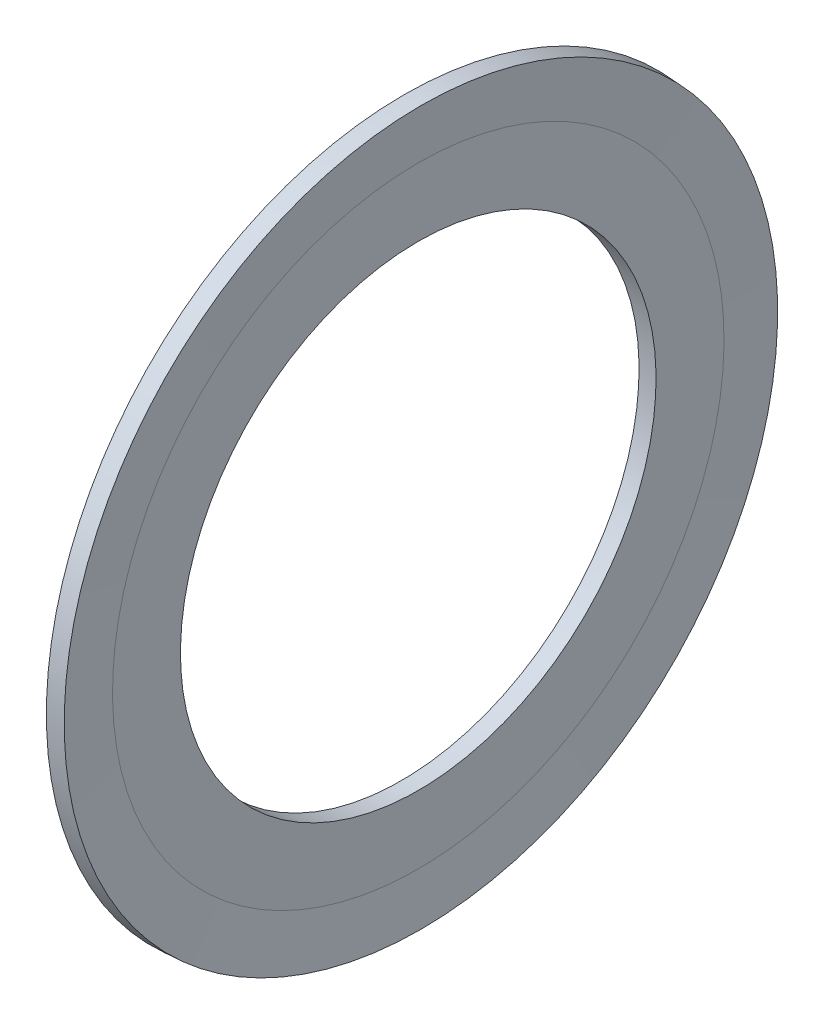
ISO-10303-21;
HEADER;
FILE_DESCRIPTION(('STEP AP214'),'2;1');
FILE_NAME('part.step','',(''),(''),'','','');
FILE_SCHEMA(('AUTOMOTIVE_DESIGN { 1 0 10303 214 1 1 1 1 }'));
ENDSEC;
DATA;
#1=APPLICATION_CONTEXT('core data for automotive mechanical design processes');
#2=APPLICATION_PROTOCOL_DEFINITION('international standard','automotive_design',2000,#1);
#3=PRODUCT_CONTEXT('',#1,'mechanical');
#4=PRODUCT('Part','Part','',(#3));
#5=PRODUCT_RELATED_PRODUCT_CATEGORY('part','',(#4));
#6=PRODUCT_DEFINITION_FORMATION('','',#4);
#7=PRODUCT_DEFINITION_CONTEXT('part definition',#1,'design');
#8=PRODUCT_DEFINITION('design','',#6,#7);
#9=PRODUCT_DEFINITION_SHAPE('','',#8);
#10=(LENGTH_UNIT() NAMED_UNIT(*) SI_UNIT(.MILLI.,.METRE.));
#11=(NAMED_UNIT(*) PLANE_ANGLE_UNIT() SI_UNIT($,.RADIAN.));
#12=(NAMED_UNIT(*) SI_UNIT($,.STERADIAN.) SOLID_ANGLE_UNIT());
#13=UNCERTAINTY_MEASURE_WITH_UNIT(LENGTH_MEASURE(1.E-05),#10,'distance_accuracy_value','');
#14=(GEOMETRIC_REPRESENTATION_CONTEXT(3) GLOBAL_UNCERTAINTY_ASSIGNED_CONTEXT((#13)) GLOBAL_UNIT_ASSIGNED_CONTEXT((#10,
#11,#12)) REPRESENTATION_CONTEXT('',''));
#15=CARTESIAN_POINT('',(0.,0.,0.));
#16=DIRECTION('',(0.,0.,1.));
#17=DIRECTION('',(1.,0.,0.));
#18=AXIS2_PLACEMENT_3D('',#15,#16,#17);
#19=CARTESIAN_POINT('',(0.,0.,0.));
#20=DIRECTION('',(0.999999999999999,0.,0.));
#21=DIRECTION('',(0.,1.,0.));
#22=AXIS2_PLACEMENT_3D('',#19,#20,#21);
#23=CONICAL_SURFACE('',#22,18.,1.51843644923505);
#24=CARTESIAN_POINT('',(0.157223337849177,0.,0.));
#25=DIRECTION('',(0.999999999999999,0.,0.));
#26=DIRECTION('',(0.,1.,0.));
#27=AXIS2_PLACEMENT_3D('',#24,#25,#26);
#28=CIRCLE('',#27,21.);
#29=CARTESIAN_POINT('',(0.157223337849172,21.0000000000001,0.));
#30=VERTEX_POINT('',#29);
#31=EDGE_CURVE('E10',#30,#30,#28,.T.);
#32=CARTESIAN_POINT('',(0.,0.,0.));
#33=DIRECTION('',(0.999999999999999,0.,0.));
#34=DIRECTION('',(0.,1.,0.));
#35=AXIS2_PLACEMENT_3D('',#32,#33,#34);
#36=CIRCLE('',#35,18.);
#37=CARTESIAN_POINT('',(0.,18.0000000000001,0.));
#38=VERTEX_POINT('',#37);
#39=EDGE_CURVE('E51',#38,#38,#36,.T.);
#40=CARTESIAN_POINT('',(0.157223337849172,21.0000000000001,0.));
#41=CARTESIAN_POINT('',(0.155585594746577,20.9687500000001,0.));
#42=CARTESIAN_POINT('',(0.153947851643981,20.9375000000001,0.));
#43=CARTESIAN_POINT('',(0.15067236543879,20.8750000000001,0.));
#44=CARTESIAN_POINT('',(0.149034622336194,20.8437500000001,0.));
#45=CARTESIAN_POINT('',(0.145759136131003,20.7812500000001,0.));
#46=CARTESIAN_POINT('',(0.144121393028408,20.7500000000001,0.));
#47=CARTESIAN_POINT('',(0.140845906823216,20.6875000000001,0.));
#48=CARTESIAN_POINT('',(0.139208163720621,20.6562500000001,0.));
#49=CARTESIAN_POINT('',(0.13593267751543,20.5937500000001,0.));
#50=CARTESIAN_POINT('',(0.134294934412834,20.5625000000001,0.));
#51=CARTESIAN_POINT('',(0.131019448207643,20.5000000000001,0.));
#52=CARTESIAN_POINT('',(0.129381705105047,20.4687500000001,0.));
#53=CARTESIAN_POINT('',(0.126106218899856,20.4062500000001,0.));
#54=CARTESIAN_POINT('',(0.124468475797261,20.3750000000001,0.));
#55=CARTESIAN_POINT('',(0.121192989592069,20.3125000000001,0.));
#56=CARTESIAN_POINT('',(0.119555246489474,20.2812500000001,0.));
#57=CARTESIAN_POINT('',(0.116279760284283,20.2187500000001,0.));
#58=CARTESIAN_POINT('',(0.114642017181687,20.1875000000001,0.));
#59=CARTESIAN_POINT('',(0.111366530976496,20.1250000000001,0.));
#60=CARTESIAN_POINT('',(0.1097287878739,20.0937500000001,0.));
#61=CARTESIAN_POINT('',(0.106453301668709,20.0312500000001,0.));
#62=CARTESIAN_POINT('',(0.104815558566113,20.0000000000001,0.));
#63=CARTESIAN_POINT('',(0.101540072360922,19.9375000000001,0.));
#64=CARTESIAN_POINT('',(0.0999023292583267,19.9062500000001,0.));
#65=CARTESIAN_POINT('',(0.0966268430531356,19.8437500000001,0.));
#66=CARTESIAN_POINT('',(0.09498909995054,19.8125000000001,0.));
#67=CARTESIAN_POINT('',(0.0917136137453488,19.7500000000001,0.));
#68=CARTESIAN_POINT('',(0.0900758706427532,19.7187500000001,0.));
#69=CARTESIAN_POINT('',(0.086800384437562,19.6562500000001,0.));
#70=CARTESIAN_POINT('',(0.0851626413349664,19.6250000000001,0.));
#71=CARTESIAN_POINT('',(0.0818871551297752,19.5625000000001,0.));
#72=CARTESIAN_POINT('',(0.0802494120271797,19.5312500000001,0.));
#73=CARTESIAN_POINT('',(0.0769739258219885,19.4687500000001,0.));
#74=CARTESIAN_POINT('',(0.0753361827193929,19.4375000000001,0.));
#75=CARTESIAN_POINT('',(0.0720606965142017,19.3750000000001,0.));
#76=CARTESIAN_POINT('',(0.0704229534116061,19.3437500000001,0.));
#77=CARTESIAN_POINT('',(0.067147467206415,19.2812500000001,0.));
#78=CARTESIAN_POINT('',(0.0655097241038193,19.2500000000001,0.));
#79=CARTESIAN_POINT('',(0.0622342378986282,19.1875000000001,0.));
#80=CARTESIAN_POINT('',(0.0605964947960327,19.1562500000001,0.));
#81=CARTESIAN_POINT('',(0.0573210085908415,19.0937500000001,0.));
#82=CARTESIAN_POINT('',(0.0556832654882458,19.0625000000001,0.));
#83=CARTESIAN_POINT('',(0.0524077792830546,19.0000000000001,0.));
#84=CARTESIAN_POINT('',(0.0507700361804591,18.9687500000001,0.));
#85=CARTESIAN_POINT('',(0.0474945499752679,18.9062500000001,0.));
#86=CARTESIAN_POINT('',(0.0458568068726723,18.8750000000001,0.));
#87=CARTESIAN_POINT('',(0.0425813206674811,18.8125000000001,0.));
#88=CARTESIAN_POINT('',(0.0409435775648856,18.7812500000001,0.));
#89=CARTESIAN_POINT('',(0.0376680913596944,18.7187500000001,0.));
#90=CARTESIAN_POINT('',(0.0360303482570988,18.6875000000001,0.));
#91=CARTESIAN_POINT('',(0.0327548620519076,18.6250000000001,0.));
#92=CARTESIAN_POINT('',(0.031117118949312,18.5937500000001,0.));
#93=CARTESIAN_POINT('',(0.0278416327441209,18.5312500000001,0.));
#94=CARTESIAN_POINT('',(0.0262038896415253,18.5000000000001,0.));
#95=CARTESIAN_POINT('',(0.0229284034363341,18.4375000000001,0.));
#96=CARTESIAN_POINT('',(0.0212906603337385,18.4062500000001,0.));
#97=CARTESIAN_POINT('',(0.0180151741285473,18.3437500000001,0.));
#98=CARTESIAN_POINT('',(0.0163774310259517,18.3125000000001,0.));
#99=CARTESIAN_POINT('',(0.0131019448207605,18.2500000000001,0.));
#100=CARTESIAN_POINT('',(0.011464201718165,18.2187500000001,0.));
#101=CARTESIAN_POINT('',(0.00818871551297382,18.1562500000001,0.));
#102=CARTESIAN_POINT('',(0.00655097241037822,18.1250000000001,0.));
#103=CARTESIAN_POINT('',(0.00327548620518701,18.0625000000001,0.));
#104=CARTESIAN_POINT('',(0.00163774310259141,18.0312500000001,0.));
#105=CARTESIAN_POINT('',(0.,18.0000000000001,0.));
#106=B_SPLINE_CURVE_WITH_KNOTS('',3,(#40,#41,#42,#43,#44,#45,#46,#47,#48,#49,#50,#51,#52,#53,
#54,#55,#56,#57,#58,#59,#60,#61,#62,#63,#64,#65,#66,#67,#68,#69,#70,#71,#72,#73,#74,#75,#76,#77,
#78,#79,#80,#81,#82,#83,#84,#85,#86,#87,#88,#89,#90,#91,#92,#93,#94,#95,#96,#97,#98,#99,#100,
#101,#102,#103,#104,#105),.UNSPECIFIED.,.F.,.F.,(4,2,2,2,2,2,2,2,2,2,2,2,2,2,2,2,2,2,2,2,2,2,2,
2,2,2,2,2,2,2,2,2,4),(0.,0.0938786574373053,0.187757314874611,0.281635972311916,
0.375514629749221,0.469393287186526,0.563271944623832,0.657150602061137,0.751029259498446,
0.844907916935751,0.938786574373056,1.03266523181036,1.12654388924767,1.22042254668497,
1.31430120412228,1.40817986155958,1.50205851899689,1.59593717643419,1.6898158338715,
1.7836944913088,1.87757314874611,1.97145180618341,2.06533046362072,2.15920912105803,
2.25308777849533,2.34696643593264,2.44084509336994,2.53472375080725,2.62860240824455,
2.72248106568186,2.81635972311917,2.91023838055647,3.00411703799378),.UNSPECIFIED.);
#107=EDGE_CURVE('BSEAM29',#30,#38,#106,.T.);
#108=ORIENTED_EDGE('',*,*,#31,.T.);
#109=ORIENTED_EDGE('',*,*,#39,.F.);
#110=ORIENTED_EDGE('',*,*,#107,.T.);
#111=ORIENTED_EDGE('',*,*,#107,.F.);
#112=EDGE_LOOP('',(#108,#110,#109,#111));
#113=FACE_BOUND('',#112,.T.);
#114=ADVANCED_FACE('F29',(#113),#23,.F.);
#115=CARTESIAN_POINT('',(0.157223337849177,0.,0.));
#116=DIRECTION('',(-0.999999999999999,0.,0.));
#117=DIRECTION('',(0.,-1.,0.));
#118=AXIS2_PLACEMENT_3D('',#115,#116,#117);
#119=CONICAL_SURFACE('',#118,21.,0.0523598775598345);
#120=CARTESIAN_POINT('',(-0.841406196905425,0.,0.));
#121=DIRECTION('',(0.999999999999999,0.,0.));
#122=DIRECTION('',(0.,1.,0.));
#123=AXIS2_PLACEMENT_3D('',#120,#121,#122);
#124=CIRCLE('',#123,21.0523359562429);
#125=CARTESIAN_POINT('',(-0.84140619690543,21.052335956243,0.));
#126=VERTEX_POINT('',#125);
#127=EDGE_CURVE('E35',#126,#126,#124,.T.);
#128=ORIENTED_EDGE('',*,*,#127,.T.);
#129=EDGE_LOOP('',(#128));
#130=FACE_BOUND('',#129,.T.);
#131=ORIENTED_EDGE('',*,*,#31,.F.);
#132=EDGE_LOOP('',(#131));
#133=FACE_BOUND('',#132,.T.);
#134=ADVANCED_FACE('F59',(#130,#133),#119,.T.);
#135=CARTESIAN_POINT('',(-0.841406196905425,0.,0.));
#136=DIRECTION('',(0.999999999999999,0.,0.));
#137=DIRECTION('',(0.,1.,0.));
#138=AXIS2_PLACEMENT_3D('',#135,#136,#137);
#139=CONICAL_SURFACE('',#138,21.0523359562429,1.51843644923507);
#140=CARTESIAN_POINT('',(-1.,0.,0.));
#141=DIRECTION('',(0.999999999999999,0.,0.));
#142=DIRECTION('',(0.,1.,0.));
#143=AXIS2_PLACEMENT_3D('',#140,#141,#142);
#144=CIRCLE('',#143,18.0261859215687);
#145=CARTESIAN_POINT('',(-1.,18.0261859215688,0.));
#146=VERTEX_POINT('',#145);
#147=EDGE_CURVE('E39',#146,#146,#144,.T.);
#148=CARTESIAN_POINT('',(-1.,18.0261859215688,0.));
#149=CARTESIAN_POINT('',(-0.99834798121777,18.0577083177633,0.));
#150=CARTESIAN_POINT('',(-0.996695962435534,18.0892307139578,0.));
#151=CARTESIAN_POINT('',(-0.993391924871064,18.1522755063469,0.));
#152=CARTESIAN_POINT('',(-0.991739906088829,18.1837979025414,0.));
#153=CARTESIAN_POINT('',(-0.988435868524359,18.2468426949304,0.));
#154=CARTESIAN_POINT('',(-0.986783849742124,18.278365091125,0.));
#155=CARTESIAN_POINT('',(-0.983479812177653,18.341409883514,0.));
#156=CARTESIAN_POINT('',(-0.981827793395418,18.3729322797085,0.));
#157=CARTESIAN_POINT('',(-0.978523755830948,18.4359770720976,0.));
#158=CARTESIAN_POINT('',(-0.976871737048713,18.4674994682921,0.));
#159=CARTESIAN_POINT('',(-0.973567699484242,18.5305442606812,0.));
#160=CARTESIAN_POINT('',(-0.971915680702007,18.5620666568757,0.));
#161=CARTESIAN_POINT('',(-0.968611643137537,18.6251114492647,0.));
#162=CARTESIAN_POINT('',(-0.966959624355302,18.6566338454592,0.));
#163=CARTESIAN_POINT('',(-0.963655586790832,18.7196786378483,0.));
#164=CARTESIAN_POINT('',(-0.962003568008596,18.7512010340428,0.));
#165=CARTESIAN_POINT('',(-0.958699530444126,18.8142458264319,0.));
#166=CARTESIAN_POINT('',(-0.957047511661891,18.8457682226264,0.));
#167=CARTESIAN_POINT('',(-0.953743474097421,18.9088130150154,0.));
#168=CARTESIAN_POINT('',(-0.952091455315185,18.94033541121,0.));
#169=CARTESIAN_POINT('',(-0.948787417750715,19.003380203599,0.));
#170=CARTESIAN_POINT('',(-0.94713539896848,19.0349025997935,0.));
#171=CARTESIAN_POINT('',(-0.94383136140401,19.0979473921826,0.));
#172=CARTESIAN_POINT('',(-0.942179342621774,19.1294697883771,0.));
#173=CARTESIAN_POINT('',(-0.938875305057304,19.1925145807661,0.));
#174=CARTESIAN_POINT('',(-0.937223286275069,19.2240369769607,0.));
#175=CARTESIAN_POINT('',(-0.933919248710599,19.2870817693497,0.));
#176=CARTESIAN_POINT('',(-0.932267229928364,19.3186041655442,0.));
#177=CARTESIAN_POINT('',(-0.928963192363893,19.3816489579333,0.));
#178=CARTESIAN_POINT('',(-0.927311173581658,19.4131713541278,0.));
#179=CARTESIAN_POINT('',(-0.924007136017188,19.4762161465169,0.));
#180=CARTESIAN_POINT('',(-0.922355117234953,19.5077385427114,0.));
#181=CARTESIAN_POINT('',(-0.919051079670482,19.5707833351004,0.));
#182=CARTESIAN_POINT('',(-0.917399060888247,19.602305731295,0.));
#183=CARTESIAN_POINT('',(-0.914095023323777,19.665350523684,0.));
#184=CARTESIAN_POINT('',(-0.912443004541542,19.6968729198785,0.));
#185=CARTESIAN_POINT('',(-0.909138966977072,19.7599177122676,0.));
#186=CARTESIAN_POINT('',(-0.907486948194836,19.7914401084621,0.));
#187=CARTESIAN_POINT('',(-0.904182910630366,19.8544849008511,0.));
#188=CARTESIAN_POINT('',(-0.902530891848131,19.8860072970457,0.));
#189=CARTESIAN_POINT('',(-0.899226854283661,19.9490520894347,0.));
#190=CARTESIAN_POINT('',(-0.897574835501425,19.9805744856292,0.));
#191=CARTESIAN_POINT('',(-0.894270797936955,20.0436192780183,0.));
#192=CARTESIAN_POINT('',(-0.89261877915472,20.0751416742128,0.));
#193=CARTESIAN_POINT('',(-0.88931474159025,20.1381864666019,0.));
#194=CARTESIAN_POINT('',(-0.887662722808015,20.1697088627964,0.));
#195=CARTESIAN_POINT('',(-0.884358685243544,20.2327536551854,0.));
#196=CARTESIAN_POINT('',(-0.882706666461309,20.26427605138,0.));
#197=CARTESIAN_POINT('',(-0.879402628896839,20.327320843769,0.));
#198=CARTESIAN_POINT('',(-0.877750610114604,20.3588432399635,0.));
#199=CARTESIAN_POINT('',(-0.874446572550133,20.4218880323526,0.));
#200=CARTESIAN_POINT('',(-0.872794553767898,20.4534104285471,0.));
#201=CARTESIAN_POINT('',(-0.869490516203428,20.5164552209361,0.));
#202=CARTESIAN_POINT('',(-0.867838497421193,20.5479776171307,0.));
#203=CARTESIAN_POINT('',(-0.864534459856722,20.6110224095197,0.));
#204=CARTESIAN_POINT('',(-0.862882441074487,20.6425448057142,0.));
#205=CARTESIAN_POINT('',(-0.859578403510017,20.7055895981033,0.));
#206=CARTESIAN_POINT('',(-0.857926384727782,20.7371119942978,0.));
#207=CARTESIAN_POINT('',(-0.854622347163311,20.8001567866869,0.));
#208=CARTESIAN_POINT('',(-0.852970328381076,20.8316791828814,0.));
#209=CARTESIAN_POINT('',(-0.849666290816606,20.8947239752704,0.));
#210=CARTESIAN_POINT('',(-0.848014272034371,20.9262463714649,0.));
#211=CARTESIAN_POINT('',(-0.8447102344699,20.989291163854,0.));
#212=CARTESIAN_POINT('',(-0.843058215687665,21.0208135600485,0.));
#213=CARTESIAN_POINT('',(-0.84140619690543,21.052335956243,0.));
#214=B_SPLINE_CURVE_WITH_KNOTS('',3,(#148,#149,#150,#151,#152,#153,#154,#155,#156,#157,#158,
#159,#160,#161,#162,#163,#164,#165,#166,#167,#168,#169,#170,#171,#172,#173,#174,#175,#176,#177,
#178,#179,#180,#181,#182,#183,#184,#185,#186,#187,#188,#189,#190,#191,#192,#193,#194,#195,#196,
#197,#198,#199,#200,#201,#202,#203,#204,#205,#206,#207,#208,#209,#210,#211,#212,#213),
.UNSPECIFIED.,.F.,.F.,(4,2,2,2,2,2,2,2,2,2,2,2,2,2,2,2,2,2,2,2,2,2,2,2,2,2,2,2,2,2,2,2,4),(0.,
0.0946969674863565,0.189393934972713,0.284090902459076,0.378787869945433,0.473484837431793,
0.568181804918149,0.662878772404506,0.757575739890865,0.852272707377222,0.946969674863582,
1.04166664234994,1.13636360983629,1.23106057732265,1.32575754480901,1.42045451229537,
1.51515147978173,1.60984844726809,1.70454541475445,1.7992423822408,1.89393934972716,
1.98863631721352,2.08333328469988,2.17803025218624,2.27272721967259,2.36742418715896,
2.46212115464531,2.55681812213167,2.65151508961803,2.74621205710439,2.84090902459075,
2.9356059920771,3.03030295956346),.UNSPECIFIED.);
#215=EDGE_CURVE('BSEAM63',#146,#126,#214,.T.);
#216=ORIENTED_EDGE('',*,*,#147,.T.);
#217=ORIENTED_EDGE('',*,*,#127,.F.);
#218=ORIENTED_EDGE('',*,*,#215,.T.);
#219=ORIENTED_EDGE('',*,*,#215,.F.);
#220=EDGE_LOOP('',(#216,#218,#217,#219));
#221=FACE_BOUND('',#220,.T.);
#222=ADVANCED_FACE('F63',(#221),#139,.T.);
#223=CARTESIAN_POINT('',(-1.,18.0261859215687,0.));
#224=DIRECTION('',(-0.999999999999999,0.,0.));
#225=DIRECTION('',(0.,-1.,0.));
#226=AXIS2_PLACEMENT_3D('',#223,#224,#225);
#227=PLANE('',#226);
#228=CARTESIAN_POINT('',(-1.,0.,0.));
#229=DIRECTION('',(0.999999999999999,0.,0.));
#230=DIRECTION('',(0.,1.,0.));
#231=AXIS2_PLACEMENT_3D('',#228,#229,#230);
#232=CIRCLE('',#231,13.9999999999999);
#233=CARTESIAN_POINT('',(-1.,14.,0.));
#234=VERTEX_POINT('',#233);
#235=EDGE_CURVE('E43',#234,#234,#232,.T.);
#236=ORIENTED_EDGE('',*,*,#235,.T.);
#237=EDGE_LOOP('',(#236));
#238=FACE_BOUND('',#237,.T.);
#239=ORIENTED_EDGE('',*,*,#147,.F.);
#240=EDGE_LOOP('',(#239));
#241=FACE_BOUND('',#240,.T.);
#242=ADVANCED_FACE('F67',(#238,#241),#227,.T.);
#243=CARTESIAN_POINT('',(19.9999999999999,0.,0.));
#244=DIRECTION('',(0.999999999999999,0.,0.));
#245=DIRECTION('',(0.,1.,0.));
#246=AXIS2_PLACEMENT_3D('',#243,#244,#245);
#247=CYLINDRICAL_SURFACE('',#246,13.9999999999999);
#248=CARTESIAN_POINT('',(0.,0.,0.));
#249=DIRECTION('',(0.999999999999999,0.,0.));
#250=DIRECTION('',(0.,1.,0.));
#251=AXIS2_PLACEMENT_3D('',#248,#249,#250);
#252=CIRCLE('',#251,13.9999999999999);
#253=CARTESIAN_POINT('',(0.,14.,0.));
#254=VERTEX_POINT('',#253);
#255=EDGE_CURVE('E48',#254,#254,#252,.T.);
#256=CARTESIAN_POINT('',(0.,14.,0.));
#257=CARTESIAN_POINT('',(-0.0104166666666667,14.,0.));
#258=CARTESIAN_POINT('',(-0.0208333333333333,14.,0.));
#259=CARTESIAN_POINT('',(-0.0416666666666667,14.,0.));
#260=CARTESIAN_POINT('',(-0.0520833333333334,14.,0.));
#261=CARTESIAN_POINT('',(-0.0729166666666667,14.,0.));
#262=CARTESIAN_POINT('',(-0.0833333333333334,14.,0.));
#263=CARTESIAN_POINT('',(-0.104166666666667,14.,0.));
#264=CARTESIAN_POINT('',(-0.114583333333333,14.,0.));
#265=CARTESIAN_POINT('',(-0.135416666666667,14.,0.));
#266=CARTESIAN_POINT('',(-0.145833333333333,14.,0.));
#267=CARTESIAN_POINT('',(-0.166666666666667,14.,0.));
#268=CARTESIAN_POINT('',(-0.177083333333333,14.,0.));
#269=CARTESIAN_POINT('',(-0.197916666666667,14.,0.));
#270=CARTESIAN_POINT('',(-0.208333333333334,14.,0.));
#271=CARTESIAN_POINT('',(-0.229166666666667,14.,0.));
#272=CARTESIAN_POINT('',(-0.239583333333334,14.,0.));
#273=CARTESIAN_POINT('',(-0.260416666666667,14.,0.));
#274=CARTESIAN_POINT('',(-0.270833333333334,14.,0.));
#275=CARTESIAN_POINT('',(-0.291666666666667,14.,0.));
#276=CARTESIAN_POINT('',(-0.302083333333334,14.,0.));
#277=CARTESIAN_POINT('',(-0.322916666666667,14.,0.));
#278=CARTESIAN_POINT('',(-0.333333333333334,14.,0.));
#279=CARTESIAN_POINT('',(-0.354166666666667,14.,0.));
#280=CARTESIAN_POINT('',(-0.364583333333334,14.,0.));
#281=CARTESIAN_POINT('',(-0.385416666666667,14.,0.));
#282=CARTESIAN_POINT('',(-0.395833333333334,14.,0.));
#283=CARTESIAN_POINT('',(-0.416666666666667,14.,0.));
#284=CARTESIAN_POINT('',(-0.427083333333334,14.,0.));
#285=CARTESIAN_POINT('',(-0.447916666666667,14.,0.));
#286=CARTESIAN_POINT('',(-0.458333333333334,14.,0.));
#287=CARTESIAN_POINT('',(-0.479166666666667,14.,0.));
#288=CARTESIAN_POINT('',(-0.489583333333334,14.,0.));
#289=CARTESIAN_POINT('',(-0.510416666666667,14.,0.));
#290=CARTESIAN_POINT('',(-0.520833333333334,14.,0.));
#291=CARTESIAN_POINT('',(-0.541666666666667,14.,0.));
#292=CARTESIAN_POINT('',(-0.552083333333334,14.,0.));
#293=CARTESIAN_POINT('',(-0.572916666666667,14.,0.));
#294=CARTESIAN_POINT('',(-0.583333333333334,14.,0.));
#295=CARTESIAN_POINT('',(-0.604166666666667,14.,0.));
#296=CARTESIAN_POINT('',(-0.614583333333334,14.,0.));
#297=CARTESIAN_POINT('',(-0.635416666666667,14.,0.));
#298=CARTESIAN_POINT('',(-0.645833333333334,14.,0.));
#299=CARTESIAN_POINT('',(-0.666666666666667,14.,0.));
#300=CARTESIAN_POINT('',(-0.677083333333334,14.,0.));
#301=CARTESIAN_POINT('',(-0.697916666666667,14.,0.));
#302=CARTESIAN_POINT('',(-0.708333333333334,14.,0.));
#303=CARTESIAN_POINT('',(-0.729166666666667,14.,0.));
#304=CARTESIAN_POINT('',(-0.739583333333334,14.,0.));
#305=CARTESIAN_POINT('',(-0.760416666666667,14.,0.));
#306=CARTESIAN_POINT('',(-0.770833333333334,14.,0.));
#307=CARTESIAN_POINT('',(-0.791666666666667,14.,0.));
#308=CARTESIAN_POINT('',(-0.802083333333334,14.,0.));
#309=CARTESIAN_POINT('',(-0.822916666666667,14.,0.));
#310=CARTESIAN_POINT('',(-0.833333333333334,14.,0.));
#311=CARTESIAN_POINT('',(-0.854166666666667,14.,0.));
#312=CARTESIAN_POINT('',(-0.864583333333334,14.,0.));
#313=CARTESIAN_POINT('',(-0.885416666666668,14.,0.));
#314=CARTESIAN_POINT('',(-0.895833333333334,14.,0.));
#315=CARTESIAN_POINT('',(-0.916666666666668,14.,0.));
#316=CARTESIAN_POINT('',(-0.927083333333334,14.,0.));
#317=CARTESIAN_POINT('',(-0.947916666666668,14.,0.));
#318=CARTESIAN_POINT('',(-0.958333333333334,14.,0.));
#319=CARTESIAN_POINT('',(-0.979166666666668,14.,0.));
#320=CARTESIAN_POINT('',(-0.989583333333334,14.,0.));
#321=CARTESIAN_POINT('',(-1.,14.,0.));
#322=B_SPLINE_CURVE_WITH_KNOTS('',3,(#256,#257,#258,#259,#260,#261,#262,#263,#264,#265,#266,
#267,#268,#269,#270,#271,#272,#273,#274,#275,#276,#277,#278,#279,#280,#281,#282,#283,#284,#285,
#286,#287,#288,#289,#290,#291,#292,#293,#294,#295,#296,#297,#298,#299,#300,#301,#302,#303,#304,
#305,#306,#307,#308,#309,#310,#311,#312,#313,#314,#315,#316,#317,#318,#319,#320,#321),
.UNSPECIFIED.,.F.,.F.,(4,2,2,2,2,2,2,2,2,2,2,2,2,2,2,2,2,2,2,2,2,2,2,2,2,2,2,2,2,2,2,2,4),(0.,
0.03125,0.0625000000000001,0.0937500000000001,0.125,0.15625,0.1875,0.21875,0.25,0.28125,0.3125,
0.34375,0.375,0.40625,0.4375,0.46875,0.5,0.53125,0.5625,0.593750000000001,0.625000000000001,
0.656250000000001,0.687500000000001,0.718750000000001,0.750000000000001,0.781250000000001,
0.812500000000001,0.843750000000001,0.875000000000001,0.906250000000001,0.937500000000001,
0.968750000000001,1.),.UNSPECIFIED.);
#323=EDGE_CURVE('BSEAM74',#254,#234,#322,.T.);
#324=ORIENTED_EDGE('',*,*,#255,.T.);
#325=ORIENTED_EDGE('',*,*,#235,.F.);
#326=ORIENTED_EDGE('',*,*,#323,.T.);
#327=ORIENTED_EDGE('',*,*,#323,.F.);
#328=EDGE_LOOP('',(#324,#326,#325,#327));
#329=FACE_BOUND('',#328,.T.);
#330=ADVANCED_FACE('F74',(#329),#247,.F.);
#331=CARTESIAN_POINT('',(0.,14.0000000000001,-1.6826817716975E-13));
#332=DIRECTION('',(0.999999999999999,0.,0.));
#333=DIRECTION('',(0.,1.,0.));
#334=AXIS2_PLACEMENT_3D('',#331,#332,#333);
#335=PLANE('',#334);
#336=ORIENTED_EDGE('',*,*,#39,.T.);
#337=EDGE_LOOP('',(#336));
#338=FACE_BOUND('',#337,.T.);
#339=ORIENTED_EDGE('',*,*,#255,.F.);
#340=EDGE_LOOP('',(#339));
#341=FACE_BOUND('',#340,.T.);
#342=ADVANCED_FACE('F55',(#338,#341),#335,.T.);
#343=CLOSED_SHELL('',(#114,#134,#222,#242,#330,#342));
#344=MANIFOLD_SOLID_BREP('B2',#343);
#345=ADVANCED_BREP_SHAPE_REPRESENTATION('',(#18,#344),#14);
#346=SHAPE_DEFINITION_REPRESENTATION(#9,#345);
ENDSEC;
END-ISO-10303-21;
